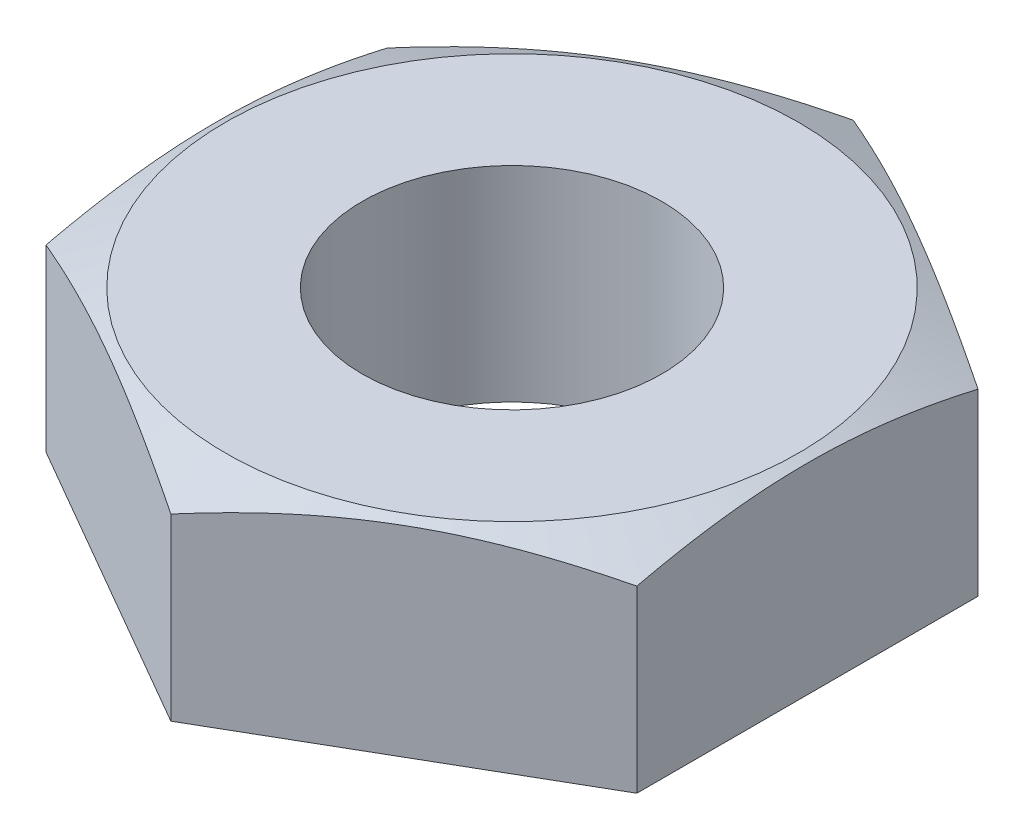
from build123d import *

# Parameters (mm, degrees)
SKETCH2_W          = 12.09837489
SKETCH2_H          = 12.09837489
CUT_EXTRUDE1_DEPTH = 3.302


with BuildPart() as part:
    # Sketch1 → Base-Revolve (revolve)
    with BuildSketch(Plane.XY, mode=Mode.PRIVATE) as base_revolve_sk:
        Polygon((2.413, 0), (2.413, 3.302), (4.619379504, 3.302), (5.499261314, 2.891704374), (5.499261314, 0), (4.28625, 0), align=None)
    revolve(base_revolve_sk.sketch.rotate(Axis((0, -33.02, 0), (0, 1, 0)), 90), axis=Axis((0, -33.02, 0), (0, 1, 0)))

    # Sketch2 → Cut-Extrude1 (cut)
    with BuildSketch(Plane(origin=(0, 0, 0), x_dir=(1, 0, 0), z_dir=(0, 1, 0))):
        Rectangle(SKETCH2_W, SKETCH2_H)
        Polygon((4.7625, 2.749630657), (0, 5.499261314), (-4.7625, 2.749630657), (-4.7625, -2.749630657), (0, -5.499261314), (4.7625, -2.749630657), align=None, mode=Mode.SUBTRACT)
    extrude(amount=CUT_EXTRUDE1_DEPTH, mode=Mode.SUBTRACT)


solid = part.part
